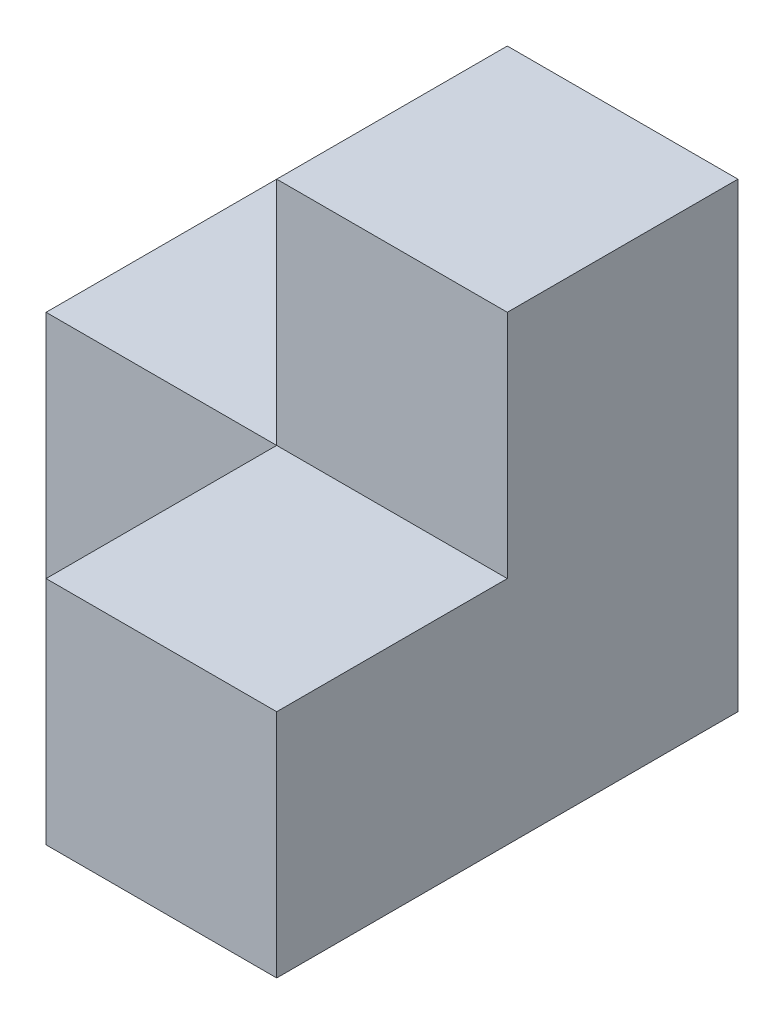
from build123d import *

# Parameters (mm, degrees)
BOSS_EXTRUDE1_DEPTH = 76.2
SKETCH2_W           = 76.2
SKETCH2_H           = 76.2
BOSS_EXTRUDE2_DEPTH = 76.2


with BuildPart() as part:
    # Sketch1 → Boss-Extrude1 (new body)
    with BuildSketch(Plane(origin=(0, 0, 0), x_dir=(1, 0, 0), z_dir=(0, 1, 0))):
        Polygon((0, 0), (-152.4, 0), (-152.4, -76.2), (-76.2, -76.2), (-76.2, -152.4), (0, -152.4), align=None)
    extrude(amount=BOSS_EXTRUDE1_DEPTH)

    # Sketch2 → Boss-Extrude2 (add)
    with BuildSketch(Plane(origin=(0, 76.2, 0), x_dir=(1, 0, 0), z_dir=(0, 1, 0))):
        with Locations((-38.1, -38.1)):
            Rectangle(SKETCH2_W, SKETCH2_H)
    extrude(amount=BOSS_EXTRUDE2_DEPTH)


solid = part.part
